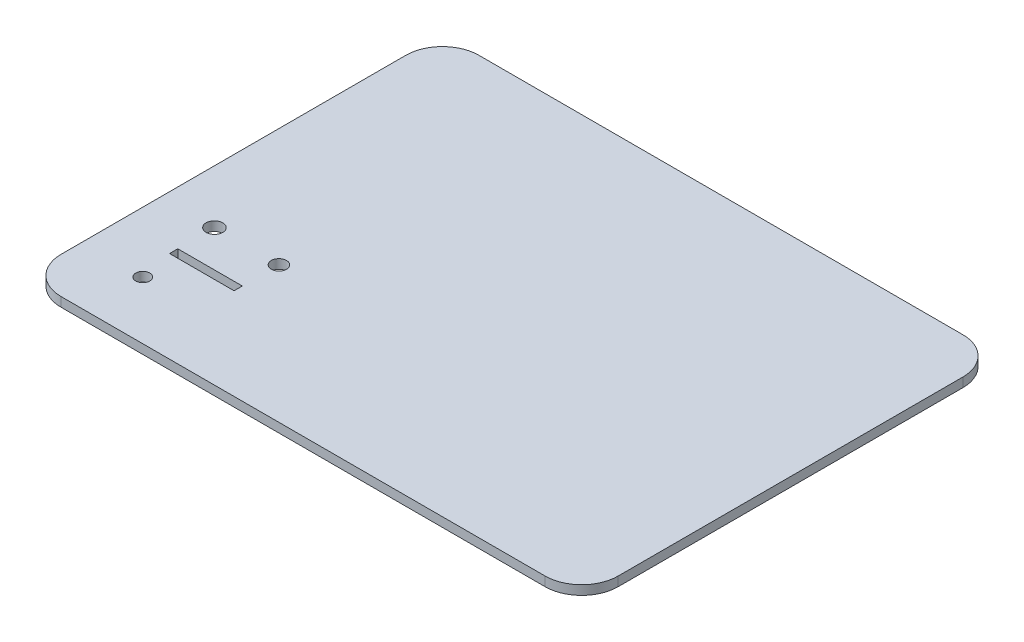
from build123d import *

# Parameters (mm, degrees)
EXTRUDE1_DEPTH     = 2.54
SKETCH2_R          = 1.905541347
SKETCH2_R_2        = 2.087181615
SKETCH2_R_3        = 2.280492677
SKETCH2_W          = 17.640842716
SKETCH2_H          = 2.253211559
CUT_EXTRUDE1_DEPTH = 2.54


with BuildPart() as part:
    # Sketch1 → Extrude1 (new body)
    with BuildSketch(Plane(origin=(0, 0, 0), x_dir=(1, 0, 0), z_dir=(0, 1, 0))):
        with BuildLine():
            Line((10, 0), (142.4, 0))
            ThreePointArc((142.4, 0), (149.471067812, 2.928932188), (152.4, 10))
            Line((152.4, 10), (152.4, 104.3))
            ThreePointArc((152.4, 104.3), (149.471067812, 111.371067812), (142.4, 114.3))
            Line((142.4, 114.3), (10, 114.3))
            ThreePointArc((10, 114.3), (2.928932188, 111.371067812), (0, 104.3))
            Line((0, 104.3), (0, 10))
            ThreePointArc((0, 10), (2.928932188, 2.928932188), (10, 0))
        make_face()
    extrude(amount=EXTRUDE1_DEPTH)

    # Sketch2 → Cut-Extrude1 (cut)
    with BuildSketch(Plane(origin=(0, 2.54, 0), x_dir=(-1, 0, 0), z_dir=(0, 1, 0))):
        with Locations(Location((-16.55655584, -15.799752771, 0), (0, 0, 90))):
            Circle(SKETCH2_R)
        with Locations(Location((-32.291857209, -37.305156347, 0), (0, 0, 90))):
            Circle(SKETCH2_R_2)
        with Locations(Location((-14.651014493, -37.305156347, 0), (0, 0, 90))):
            Circle(SKETCH2_R_3)
        with Locations((-23.471435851, -26.15598714)):
            Rectangle(SKETCH2_W, SKETCH2_H)
    extrude(amount=-CUT_EXTRUDE1_DEPTH, mode=Mode.SUBTRACT)


solid = part.part
